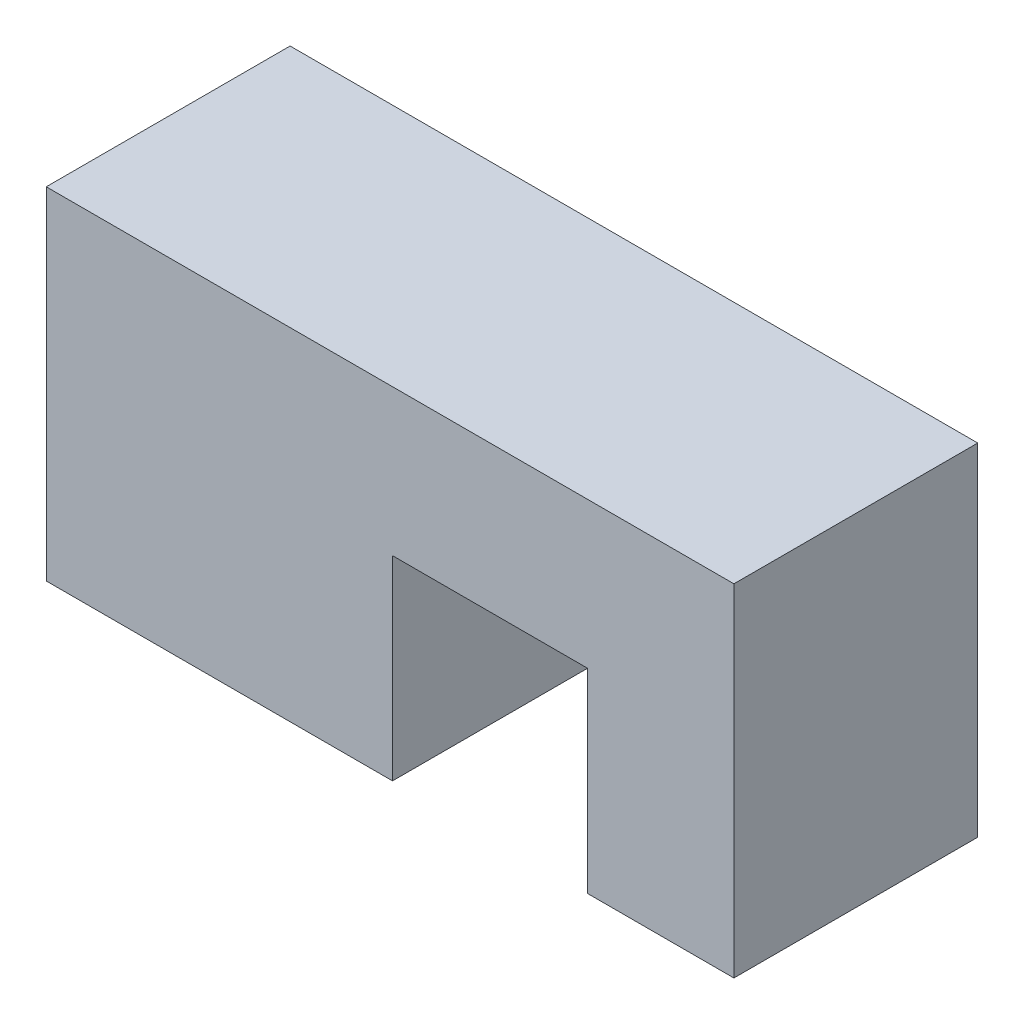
ISO-10303-21;
HEADER;
FILE_DESCRIPTION(('STEP AP214'),'2;1');
FILE_NAME('part.step','',(''),(''),'','','');
FILE_SCHEMA(('AUTOMOTIVE_DESIGN { 1 0 10303 214 1 1 1 1 }'));
ENDSEC;
DATA;
#1=APPLICATION_CONTEXT('core data for automotive mechanical design processes');
#2=APPLICATION_PROTOCOL_DEFINITION('international standard','automotive_design',2000,#1);
#3=PRODUCT_CONTEXT('',#1,'mechanical');
#4=PRODUCT('Part','Part','',(#3));
#5=PRODUCT_RELATED_PRODUCT_CATEGORY('part','',(#4));
#6=PRODUCT_DEFINITION_FORMATION('','',#4);
#7=PRODUCT_DEFINITION_CONTEXT('part definition',#1,'design');
#8=PRODUCT_DEFINITION('design','',#6,#7);
#9=PRODUCT_DEFINITION_SHAPE('','',#8);
#10=(LENGTH_UNIT() NAMED_UNIT(*) SI_UNIT(.MILLI.,.METRE.));
#11=(NAMED_UNIT(*) PLANE_ANGLE_UNIT() SI_UNIT($,.RADIAN.));
#12=(NAMED_UNIT(*) SI_UNIT($,.STERADIAN.) SOLID_ANGLE_UNIT());
#13=UNCERTAINTY_MEASURE_WITH_UNIT(LENGTH_MEASURE(1.E-05),#10,'distance_accuracy_value','');
#14=(GEOMETRIC_REPRESENTATION_CONTEXT(3) GLOBAL_UNCERTAINTY_ASSIGNED_CONTEXT((#13)) GLOBAL_UNIT_ASSIGNED_CONTEXT((#10,
#11,#12)) REPRESENTATION_CONTEXT('',''));
#15=CARTESIAN_POINT('',(0.,0.,0.));
#16=DIRECTION('',(0.,0.,1.));
#17=DIRECTION('',(1.,0.,0.));
#18=AXIS2_PLACEMENT_3D('',#15,#16,#17);
#19=CARTESIAN_POINT('',(-35.5,0.,25.));
#20=DIRECTION('',(0.,1.,0.));
#21=DIRECTION('',(0.,0.,1.));
#22=AXIS2_PLACEMENT_3D('',#19,#20,#21);
#23=PLANE('',#22);
#24=DIRECTION('',(1.,0.,0.));
#25=VECTOR('',#24,1.);
#26=CARTESIAN_POINT('',(-35.5,0.,0.));
#27=LINE('',#26,#25);
#28=CARTESIAN_POINT('',(-35.5,0.,0.));
#29=VERTEX_POINT('',#28);
#30=CARTESIAN_POINT('',(0.,0.,0.));
#31=VERTEX_POINT('',#30);
#32=EDGE_CURVE('E147',#29,#31,#27,.T.);
#33=ORIENTED_EDGE('',*,*,#32,.T.);
#34=DIRECTION('',(0.,0.,-1.));
#35=VECTOR('',#34,1.);
#36=CARTESIAN_POINT('',(0.,0.,25.));
#37=LINE('',#36,#35);
#38=CARTESIAN_POINT('',(0.,0.,25.));
#39=VERTEX_POINT('',#38);
#40=EDGE_CURVE('E11',#39,#31,#37,.T.);
#41=ORIENTED_EDGE('',*,*,#40,.F.);
#42=DIRECTION('',(1.,0.,0.));
#43=VECTOR('',#42,1.);
#44=CARTESIAN_POINT('',(-35.5,0.,25.));
#45=LINE('',#44,#43);
#46=CARTESIAN_POINT('',(-35.5,0.,25.));
#47=VERTEX_POINT('',#46);
#48=EDGE_CURVE('E166',#47,#39,#45,.T.);
#49=ORIENTED_EDGE('',*,*,#48,.F.);
#50=DIRECTION('',(0.,0.,-1.));
#51=VECTOR('',#50,1.);
#52=CARTESIAN_POINT('',(-35.5,0.,25.));
#53=LINE('',#52,#51);
#54=EDGE_CURVE('E145',#47,#29,#53,.T.);
#55=ORIENTED_EDGE('',*,*,#54,.T.);
#56=EDGE_LOOP('',(#33,#41,#49,#55));
#57=FACE_BOUND('',#56,.T.);
#58=ADVANCED_FACE('F44',(#57),#23,.F.);
#59=CARTESIAN_POINT('',(0.,0.,25.));
#60=DIRECTION('',(-1.,0.,0.));
#61=DIRECTION('',(0.,0.,1.));
#62=AXIS2_PLACEMENT_3D('',#59,#60,#61);
#63=PLANE('',#62);
#64=DIRECTION('',(0.,1.,0.));
#65=VECTOR('',#64,1.);
#66=CARTESIAN_POINT('',(0.,0.,0.));
#67=LINE('',#66,#65);
#68=CARTESIAN_POINT('',(0.,20.,0.));
#69=VERTEX_POINT('',#68);
#70=EDGE_CURVE('E148',#31,#69,#67,.T.);
#71=ORIENTED_EDGE('',*,*,#70,.T.);
#72=DIRECTION('',(0.,0.,-1.));
#73=VECTOR('',#72,1.);
#74=CARTESIAN_POINT('',(0.,20.,25.));
#75=LINE('',#74,#73);
#76=CARTESIAN_POINT('',(0.,20.,25.));
#77=VERTEX_POINT('',#76);
#78=EDGE_CURVE('E53',#77,#69,#75,.T.);
#79=ORIENTED_EDGE('',*,*,#78,.F.);
#80=DIRECTION('',(0.,1.,0.));
#81=VECTOR('',#80,1.);
#82=CARTESIAN_POINT('',(0.,0.,25.));
#83=LINE('',#82,#81);
#84=EDGE_CURVE('E101',#39,#77,#83,.T.);
#85=ORIENTED_EDGE('',*,*,#84,.F.);
#86=ORIENTED_EDGE('',*,*,#40,.T.);
#87=EDGE_LOOP('',(#71,#79,#85,#86));
#88=FACE_BOUND('',#87,.T.);
#89=ADVANCED_FACE('F215',(#88),#63,.F.);
#90=CARTESIAN_POINT('',(0.,20.,25.));
#91=DIRECTION('',(0.,1.,0.));
#92=DIRECTION('',(0.,0.,1.));
#93=AXIS2_PLACEMENT_3D('',#90,#91,#92);
#94=PLANE('',#93);
#95=DIRECTION('',(1.,0.,0.));
#96=VECTOR('',#95,1.);
#97=CARTESIAN_POINT('',(0.,20.,0.));
#98=LINE('',#97,#96);
#99=CARTESIAN_POINT('',(20.,20.,0.));
#100=VERTEX_POINT('',#99);
#101=EDGE_CURVE('E153',#69,#100,#98,.T.);
#102=ORIENTED_EDGE('',*,*,#101,.T.);
#103=DIRECTION('',(0.,0.,-1.));
#104=VECTOR('',#103,1.);
#105=CARTESIAN_POINT('',(20.,20.,25.));
#106=LINE('',#105,#104);
#107=CARTESIAN_POINT('',(20.,20.,25.));
#108=VERTEX_POINT('',#107);
#109=EDGE_CURVE('E177',#108,#100,#106,.T.);
#110=ORIENTED_EDGE('',*,*,#109,.F.);
#111=DIRECTION('',(1.,0.,0.));
#112=VECTOR('',#111,1.);
#113=CARTESIAN_POINT('',(0.,20.,25.));
#114=LINE('',#113,#112);
#115=EDGE_CURVE('E188',#77,#108,#114,.T.);
#116=ORIENTED_EDGE('',*,*,#115,.F.);
#117=ORIENTED_EDGE('',*,*,#78,.T.);
#118=EDGE_LOOP('',(#102,#110,#116,#117));
#119=FACE_BOUND('',#118,.T.);
#120=ADVANCED_FACE('F190',(#119),#94,.F.);
#121=CARTESIAN_POINT('',(20.,20.,25.));
#122=DIRECTION('',(1.,0.,0.));
#123=DIRECTION('',(0.,0.,-1.));
#124=AXIS2_PLACEMENT_3D('',#121,#122,#123);
#125=PLANE('',#124);
#126=DIRECTION('',(0.,-1.,0.));
#127=VECTOR('',#126,1.);
#128=CARTESIAN_POINT('',(20.,20.,0.));
#129=LINE('',#128,#127);
#130=CARTESIAN_POINT('',(20.,0.,0.));
#131=VERTEX_POINT('',#130);
#132=EDGE_CURVE('E157',#100,#131,#129,.T.);
#133=ORIENTED_EDGE('',*,*,#132,.T.);
#134=DIRECTION('',(0.,0.,-1.));
#135=VECTOR('',#134,1.);
#136=CARTESIAN_POINT('',(20.,0.,25.));
#137=LINE('',#136,#135);
#138=CARTESIAN_POINT('',(20.,0.,25.));
#139=VERTEX_POINT('',#138);
#140=EDGE_CURVE('E172',#139,#131,#137,.T.);
#141=ORIENTED_EDGE('',*,*,#140,.F.);
#142=DIRECTION('',(0.,-1.,0.));
#143=VECTOR('',#142,1.);
#144=CARTESIAN_POINT('',(20.,20.,25.));
#145=LINE('',#144,#143);
#146=EDGE_CURVE('E205',#108,#139,#145,.T.);
#147=ORIENTED_EDGE('',*,*,#146,.F.);
#148=ORIENTED_EDGE('',*,*,#109,.T.);
#149=EDGE_LOOP('',(#133,#141,#147,#148));
#150=FACE_BOUND('',#149,.T.);
#151=ADVANCED_FACE('F200',(#150),#125,.F.);
#152=CARTESIAN_POINT('',(20.,0.,25.));
#153=DIRECTION('',(0.,1.,0.));
#154=DIRECTION('',(0.,0.,1.));
#155=AXIS2_PLACEMENT_3D('',#152,#153,#154);
#156=PLANE('',#155);
#157=DIRECTION('',(1.,0.,0.));
#158=VECTOR('',#157,1.);
#159=CARTESIAN_POINT('',(20.,0.,0.));
#160=LINE('',#159,#158);
#161=CARTESIAN_POINT('',(35.,0.,0.));
#162=VERTEX_POINT('',#161);
#163=EDGE_CURVE('E159',#131,#162,#160,.T.);
#164=ORIENTED_EDGE('',*,*,#163,.T.);
#165=DIRECTION('',(0.,0.,-1.));
#166=VECTOR('',#165,1.);
#167=CARTESIAN_POINT('',(35.,0.,25.));
#168=LINE('',#167,#166);
#169=CARTESIAN_POINT('',(35.,0.,25.));
#170=VERTEX_POINT('',#169);
#171=EDGE_CURVE('E134',#170,#162,#168,.T.);
#172=ORIENTED_EDGE('',*,*,#171,.F.);
#173=DIRECTION('',(1.,0.,0.));
#174=VECTOR('',#173,1.);
#175=CARTESIAN_POINT('',(20.,0.,25.));
#176=LINE('',#175,#174);
#177=EDGE_CURVE('E121',#139,#170,#176,.T.);
#178=ORIENTED_EDGE('',*,*,#177,.F.);
#179=ORIENTED_EDGE('',*,*,#140,.T.);
#180=EDGE_LOOP('',(#164,#172,#178,#179));
#181=FACE_BOUND('',#180,.T.);
#182=ADVANCED_FACE('F196',(#181),#156,.F.);
#183=CARTESIAN_POINT('',(35.,0.,25.));
#184=DIRECTION('',(-1.,0.,0.));
#185=DIRECTION('',(0.,0.,1.));
#186=AXIS2_PLACEMENT_3D('',#183,#184,#185);
#187=PLANE('',#186);
#188=DIRECTION('',(0.,1.,0.));
#189=VECTOR('',#188,1.);
#190=CARTESIAN_POINT('',(35.,0.,0.));
#191=LINE('',#190,#189);
#192=CARTESIAN_POINT('',(35.,35.,0.));
#193=VERTEX_POINT('',#192);
#194=EDGE_CURVE('E133',#162,#193,#191,.T.);
#195=ORIENTED_EDGE('',*,*,#194,.T.);
#196=DIRECTION('',(0.,0.,-1.));
#197=VECTOR('',#196,1.);
#198=CARTESIAN_POINT('',(35.,35.,25.));
#199=LINE('',#198,#197);
#200=CARTESIAN_POINT('',(35.,35.,25.));
#201=VERTEX_POINT('',#200);
#202=EDGE_CURVE('E127',#201,#193,#199,.T.);
#203=ORIENTED_EDGE('',*,*,#202,.F.);
#204=DIRECTION('',(0.,1.,0.));
#205=VECTOR('',#204,1.);
#206=CARTESIAN_POINT('',(35.,0.,25.));
#207=LINE('',#206,#205);
#208=EDGE_CURVE('E120',#170,#201,#207,.T.);
#209=ORIENTED_EDGE('',*,*,#208,.F.);
#210=ORIENTED_EDGE('',*,*,#171,.T.);
#211=EDGE_LOOP('',(#195,#203,#209,#210));
#212=FACE_BOUND('',#211,.T.);
#213=ADVANCED_FACE('F131',(#212),#187,.F.);
#214=CARTESIAN_POINT('',(20.,35.,25.));
#215=DIRECTION('',(0.,-1.,0.));
#216=DIRECTION('',(1.,0.,0.));
#217=AXIS2_PLACEMENT_3D('',#214,#215,#216);
#218=PLANE('',#217);
#219=DIRECTION('',(-1.,0.,0.));
#220=VECTOR('',#219,1.);
#221=CARTESIAN_POINT('',(20.,35.,0.));
#222=LINE('',#221,#220);
#223=CARTESIAN_POINT('',(-35.5,35.,0.));
#224=VERTEX_POINT('',#223);
#225=EDGE_CURVE('E89',#193,#224,#222,.T.);
#226=ORIENTED_EDGE('',*,*,#225,.T.);
#227=DIRECTION('',(0.,0.,-1.));
#228=VECTOR('',#227,1.);
#229=CARTESIAN_POINT('',(-35.5,35.,25.));
#230=LINE('',#229,#228);
#231=CARTESIAN_POINT('',(-35.5,35.,25.));
#232=VERTEX_POINT('',#231);
#233=EDGE_CURVE('E136',#232,#224,#230,.T.);
#234=ORIENTED_EDGE('',*,*,#233,.F.);
#235=DIRECTION('',(-1.,0.,0.));
#236=VECTOR('',#235,1.);
#237=CARTESIAN_POINT('',(35.,35.,25.));
#238=LINE('',#237,#236);
#239=EDGE_CURVE('E123',#201,#232,#238,.T.);
#240=ORIENTED_EDGE('',*,*,#239,.F.);
#241=ORIENTED_EDGE('',*,*,#202,.T.);
#242=EDGE_LOOP('',(#226,#234,#240,#241));
#243=FACE_BOUND('',#242,.T.);
#244=ADVANCED_FACE('F138',(#243),#218,.F.);
#245=CARTESIAN_POINT('',(-35.5,35.,25.));
#246=DIRECTION('',(1.,0.,0.));
#247=DIRECTION('',(0.,0.,-1.));
#248=AXIS2_PLACEMENT_3D('',#245,#246,#247);
#249=PLANE('',#248);
#250=DIRECTION('',(0.,-1.,0.));
#251=VECTOR('',#250,1.);
#252=CARTESIAN_POINT('',(-35.5,35.,0.));
#253=LINE('',#252,#251);
#254=EDGE_CURVE('E96',#224,#29,#253,.T.);
#255=ORIENTED_EDGE('',*,*,#254,.T.);
#256=ORIENTED_EDGE('',*,*,#54,.F.);
#257=DIRECTION('',(0.,-1.,0.));
#258=VECTOR('',#257,1.);
#259=CARTESIAN_POINT('',(-35.5,35.,25.));
#260=LINE('',#259,#258);
#261=EDGE_CURVE('E65',#232,#47,#260,.T.);
#262=ORIENTED_EDGE('',*,*,#261,.F.);
#263=ORIENTED_EDGE('',*,*,#233,.T.);
#264=EDGE_LOOP('',(#255,#256,#262,#263));
#265=FACE_BOUND('',#264,.T.);
#266=ADVANCED_FACE('F229',(#265),#249,.F.);
#267=CARTESIAN_POINT('',(0.,0.,25.));
#268=DIRECTION('',(0.,0.,1.));
#269=DIRECTION('',(1.,0.,0.));
#270=AXIS2_PLACEMENT_3D('',#267,#268,#269);
#271=PLANE('',#270);
#272=ORIENTED_EDGE('',*,*,#48,.T.);
#273=ORIENTED_EDGE('',*,*,#84,.T.);
#274=ORIENTED_EDGE('',*,*,#115,.T.);
#275=ORIENTED_EDGE('',*,*,#146,.T.);
#276=ORIENTED_EDGE('',*,*,#177,.T.);
#277=ORIENTED_EDGE('',*,*,#208,.T.);
#278=ORIENTED_EDGE('',*,*,#239,.T.);
#279=ORIENTED_EDGE('',*,*,#261,.T.);
#280=EDGE_LOOP('',(#272,#273,#274,#275,#276,#277,#278,#279));
#281=FACE_BOUND('',#280,.T.);
#282=ADVANCED_FACE('F119',(#281),#271,.T.);
#283=CARTESIAN_POINT('',(0.,0.,0.));
#284=DIRECTION('',(0.,0.,1.));
#285=DIRECTION('',(1.,0.,0.));
#286=AXIS2_PLACEMENT_3D('',#283,#284,#285);
#287=PLANE('',#286);
#288=ORIENTED_EDGE('',*,*,#32,.F.);
#289=ORIENTED_EDGE('',*,*,#254,.F.);
#290=ORIENTED_EDGE('',*,*,#225,.F.);
#291=ORIENTED_EDGE('',*,*,#194,.F.);
#292=ORIENTED_EDGE('',*,*,#163,.F.);
#293=ORIENTED_EDGE('',*,*,#132,.F.);
#294=ORIENTED_EDGE('',*,*,#101,.F.);
#295=ORIENTED_EDGE('',*,*,#70,.F.);
#296=EDGE_LOOP('',(#288,#289,#290,#291,#292,#293,#294,#295));
#297=FACE_BOUND('',#296,.T.);
#298=ADVANCED_FACE('F194',(#297),#287,.F.);
#299=CLOSED_SHELL('',(#58,#89,#120,#151,#182,#213,#244,#266,#282,#298));
#300=MANIFOLD_SOLID_BREP('B2',#299);
#301=ADVANCED_BREP_SHAPE_REPRESENTATION('',(#18,#300),#14);
#302=SHAPE_DEFINITION_REPRESENTATION(#9,#301);
ENDSEC;
END-ISO-10303-21;
